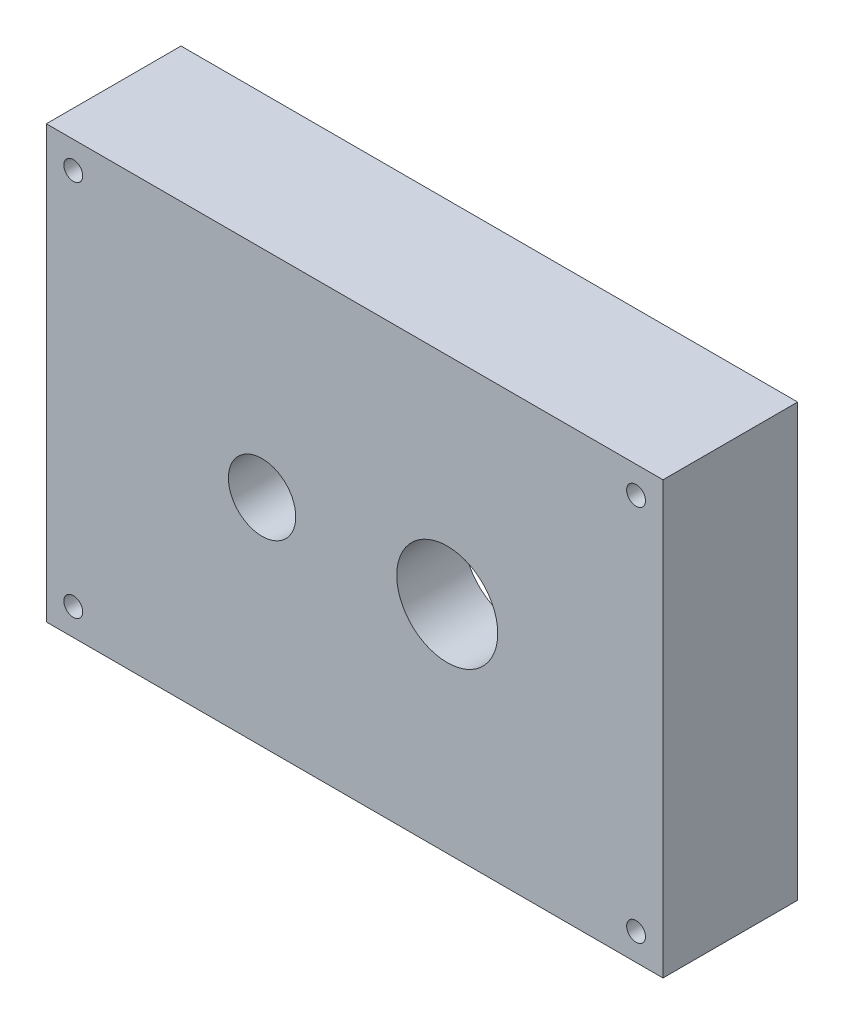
ISO-10303-21;
HEADER;
FILE_DESCRIPTION(('STEP AP214'),'2;1');
FILE_NAME('part.step','',(''),(''),'','','');
FILE_SCHEMA(('AUTOMOTIVE_DESIGN { 1 0 10303 214 1 1 1 1 }'));
ENDSEC;
DATA;
#1=APPLICATION_CONTEXT('core data for automotive mechanical design processes');
#2=APPLICATION_PROTOCOL_DEFINITION('international standard','automotive_design',2000,#1);
#3=PRODUCT_CONTEXT('',#1,'mechanical');
#4=PRODUCT('Part','Part','',(#3));
#5=PRODUCT_RELATED_PRODUCT_CATEGORY('part','',(#4));
#6=PRODUCT_DEFINITION_FORMATION('','',#4);
#7=PRODUCT_DEFINITION_CONTEXT('part definition',#1,'design');
#8=PRODUCT_DEFINITION('design','',#6,#7);
#9=PRODUCT_DEFINITION_SHAPE('','',#8);
#10=(LENGTH_UNIT() NAMED_UNIT(*) SI_UNIT(.MILLI.,.METRE.));
#11=(NAMED_UNIT(*) PLANE_ANGLE_UNIT() SI_UNIT($,.RADIAN.));
#12=(NAMED_UNIT(*) SI_UNIT($,.STERADIAN.) SOLID_ANGLE_UNIT());
#13=UNCERTAINTY_MEASURE_WITH_UNIT(LENGTH_MEASURE(1.E-05),#10,'distance_accuracy_value','');
#14=(GEOMETRIC_REPRESENTATION_CONTEXT(3) GLOBAL_UNCERTAINTY_ASSIGNED_CONTEXT((#13)) GLOBAL_UNIT_ASSIGNED_CONTEXT((#10,
#11,#12)) REPRESENTATION_CONTEXT('',''));
#15=CARTESIAN_POINT('',(0.,0.,0.));
#16=DIRECTION('',(0.,0.,1.));
#17=DIRECTION('',(1.,0.,0.));
#18=AXIS2_PLACEMENT_3D('',#15,#16,#17);
#19=CARTESIAN_POINT('',(0.,0.,0.));
#20=DIRECTION('',(0.,0.,-1.));
#21=DIRECTION('',(-1.,0.,0.));
#22=AXIS2_PLACEMENT_3D('',#19,#20,#21);
#23=PLANE('',#22);
#24=CARTESIAN_POINT('',(-26.53665,17.8054,0.));
#25=DIRECTION('',(0.,0.,1.));
#26=DIRECTION('',(1.,0.,0.));
#27=AXIS2_PLACEMENT_3D('',#24,#25,#26);
#28=CIRCLE('',#27,0.889);
#29=CARTESIAN_POINT('',(-25.64765,17.8054,0.));
#30=VERTEX_POINT('',#29);
#31=EDGE_CURVE('E341',#30,#30,#28,.T.);
#32=ORIENTED_EDGE('',*,*,#31,.T.);
#33=EDGE_LOOP('',(#32));
#34=FACE_BOUND('',#33,.T.);
#35=CARTESIAN_POINT('',(26.53665,-17.8054,0.));
#36=DIRECTION('',(0.,0.,1.));
#37=DIRECTION('',(1.,0.,0.));
#38=AXIS2_PLACEMENT_3D('',#35,#36,#37);
#39=CIRCLE('',#38,0.889);
#40=CARTESIAN_POINT('',(27.42565,-17.8054,0.));
#41=VERTEX_POINT('',#40);
#42=EDGE_CURVE('E346',#41,#41,#39,.T.);
#43=ORIENTED_EDGE('',*,*,#42,.T.);
#44=EDGE_LOOP('',(#43));
#45=FACE_BOUND('',#44,.T.);
#46=CARTESIAN_POINT('',(-26.53665,-17.8054,0.));
#47=DIRECTION('',(0.,0.,1.));
#48=DIRECTION('',(1.,0.,0.));
#49=AXIS2_PLACEMENT_3D('',#46,#47,#48);
#50=CIRCLE('',#49,0.889);
#51=CARTESIAN_POINT('',(-25.64765,-17.8054,0.));
#52=VERTEX_POINT('',#51);
#53=EDGE_CURVE('E352',#52,#52,#50,.T.);
#54=ORIENTED_EDGE('',*,*,#53,.T.);
#55=EDGE_LOOP('',(#54));
#56=FACE_BOUND('',#55,.T.);
#57=CARTESIAN_POINT('',(26.53665,17.8054,0.));
#58=DIRECTION('',(0.,0.,1.));
#59=DIRECTION('',(1.,0.,0.));
#60=AXIS2_PLACEMENT_3D('',#57,#58,#59);
#61=CIRCLE('',#60,0.889);
#62=CARTESIAN_POINT('',(27.42565,17.8054,0.));
#63=VERTEX_POINT('',#62);
#64=EDGE_CURVE('E180',#63,#63,#61,.T.);
#65=ORIENTED_EDGE('',*,*,#64,.T.);
#66=EDGE_LOOP('',(#65));
#67=FACE_BOUND('',#66,.T.);
#68=DIRECTION('',(0.,1.,0.));
#69=VECTOR('',#68,1.);
#70=CARTESIAN_POINT('',(29.07665,-20.3454,0.));
#71=LINE('',#70,#69);
#72=CARTESIAN_POINT('',(29.07665,-20.3454,0.));
#73=VERTEX_POINT('',#72);
#74=CARTESIAN_POINT('',(29.07665,20.3454,0.));
#75=VERTEX_POINT('',#74);
#76=EDGE_CURVE('E140',#73,#75,#71,.T.);
#77=ORIENTED_EDGE('',*,*,#76,.F.);
#78=DIRECTION('',(1.,0.,0.));
#79=VECTOR('',#78,1.);
#80=CARTESIAN_POINT('',(-29.07665,-20.3454,0.));
#81=LINE('',#80,#79);
#82=CARTESIAN_POINT('',(-29.07665,-20.3454,0.));
#83=VERTEX_POINT('',#82);
#84=EDGE_CURVE('E86',#83,#73,#81,.T.);
#85=ORIENTED_EDGE('',*,*,#84,.F.);
#86=DIRECTION('',(0.,-1.,0.));
#87=VECTOR('',#86,1.);
#88=CARTESIAN_POINT('',(-29.07665,-20.3454,0.));
#89=LINE('',#88,#87);
#90=CARTESIAN_POINT('',(-29.07665,20.3454,0.));
#91=VERTEX_POINT('',#90);
#92=EDGE_CURVE('E154',#91,#83,#89,.T.);
#93=ORIENTED_EDGE('',*,*,#92,.F.);
#94=DIRECTION('',(-1.,0.,0.));
#95=VECTOR('',#94,1.);
#96=CARTESIAN_POINT('',(-29.07665,20.3454,0.));
#97=LINE('',#96,#95);
#98=EDGE_CURVE('E143',#75,#91,#97,.T.);
#99=ORIENTED_EDGE('',*,*,#98,.F.);
#100=EDGE_LOOP('',(#77,#85,#93,#99));
#101=FACE_BOUND('',#100,.T.);
#102=DIRECTION('',(1.,0.,0.));
#103=VECTOR('',#102,1.);
#104=CARTESIAN_POINT('',(-23.99665,-15.2654,0.));
#105=LINE('',#104,#103);
#106=CARTESIAN_POINT('',(-23.99665,-15.2654,0.));
#107=VERTEX_POINT('',#106);
#108=CARTESIAN_POINT('',(23.99665,-15.2654,0.));
#109=VERTEX_POINT('',#108);
#110=EDGE_CURVE('E131',#107,#109,#105,.T.);
#111=ORIENTED_EDGE('',*,*,#110,.T.);
#112=DIRECTION('',(0.,1.,0.));
#113=VECTOR('',#112,1.);
#114=CARTESIAN_POINT('',(23.99665,-15.2654,0.));
#115=LINE('',#114,#113);
#116=CARTESIAN_POINT('',(23.99665,15.2654,0.));
#117=VERTEX_POINT('',#116);
#118=EDGE_CURVE('E59',#109,#117,#115,.T.);
#119=ORIENTED_EDGE('',*,*,#118,.T.);
#120=DIRECTION('',(-1.,0.,0.));
#121=VECTOR('',#120,1.);
#122=CARTESIAN_POINT('',(-23.99665,15.2654,0.));
#123=LINE('',#122,#121);
#124=CARTESIAN_POINT('',(-23.99665,15.2654,0.));
#125=VERTEX_POINT('',#124);
#126=EDGE_CURVE('E137',#117,#125,#123,.T.);
#127=ORIENTED_EDGE('',*,*,#126,.T.);
#128=DIRECTION('',(0.,-1.,0.));
#129=VECTOR('',#128,1.);
#130=CARTESIAN_POINT('',(-23.99665,-15.2654,0.));
#131=LINE('',#130,#129);
#132=EDGE_CURVE('E183',#125,#107,#131,.T.);
#133=ORIENTED_EDGE('',*,*,#132,.T.);
#134=EDGE_LOOP('',(#111,#119,#127,#133));
#135=FACE_BOUND('',#134,.T.);
#136=ADVANCED_FACE('F41',(#34,#45,#56,#67,#101,#135),#23,.T.);
#137=CARTESIAN_POINT('',(29.07665,-20.3454,12.7));
#138=DIRECTION('',(-1.,0.,0.));
#139=DIRECTION('',(0.,0.,1.));
#140=AXIS2_PLACEMENT_3D('',#137,#138,#139);
#141=PLANE('',#140);
#142=ORIENTED_EDGE('',*,*,#76,.T.);
#143=DIRECTION('',(0.,0.,-1.));
#144=VECTOR('',#143,1.);
#145=CARTESIAN_POINT('',(29.07665,20.3454,12.7));
#146=LINE('',#145,#144);
#147=CARTESIAN_POINT('',(29.07665,20.3454,12.7));
#148=VERTEX_POINT('',#147);
#149=EDGE_CURVE('E11',#148,#75,#146,.T.);
#150=ORIENTED_EDGE('',*,*,#149,.F.);
#151=DIRECTION('',(0.,1.,0.));
#152=VECTOR('',#151,1.);
#153=CARTESIAN_POINT('',(29.07665,-20.3454,12.7));
#154=LINE('',#153,#152);
#155=CARTESIAN_POINT('',(29.07665,-20.3454,12.7));
#156=VERTEX_POINT('',#155);
#157=EDGE_CURVE('E150',#156,#148,#154,.T.);
#158=ORIENTED_EDGE('',*,*,#157,.F.);
#159=DIRECTION('',(0.,0.,-1.));
#160=VECTOR('',#159,1.);
#161=CARTESIAN_POINT('',(29.07665,-20.3454,12.7));
#162=LINE('',#161,#160);
#163=EDGE_CURVE('E155',#156,#73,#162,.T.);
#164=ORIENTED_EDGE('',*,*,#163,.T.);
#165=EDGE_LOOP('',(#142,#150,#158,#164));
#166=FACE_BOUND('',#165,.T.);
#167=ADVANCED_FACE('F43',(#166),#141,.F.);
#168=CARTESIAN_POINT('',(-29.07665,20.3454,12.7));
#169=DIRECTION('',(0.,-1.,0.));
#170=DIRECTION('',(0.,0.,-1.));
#171=AXIS2_PLACEMENT_3D('',#168,#169,#170);
#172=PLANE('',#171);
#173=ORIENTED_EDGE('',*,*,#98,.T.);
#174=DIRECTION('',(0.,0.,-1.));
#175=VECTOR('',#174,1.);
#176=CARTESIAN_POINT('',(-29.07665,20.3454,12.7));
#177=LINE('',#176,#175);
#178=CARTESIAN_POINT('',(-29.07665,20.3454,12.7));
#179=VERTEX_POINT('',#178);
#180=EDGE_CURVE('E49',#179,#91,#177,.T.);
#181=ORIENTED_EDGE('',*,*,#180,.F.);
#182=DIRECTION('',(-1.,0.,0.));
#183=VECTOR('',#182,1.);
#184=CARTESIAN_POINT('',(-29.07665,20.3454,12.7));
#185=LINE('',#184,#183);
#186=EDGE_CURVE('E92',#148,#179,#185,.T.);
#187=ORIENTED_EDGE('',*,*,#186,.F.);
#188=ORIENTED_EDGE('',*,*,#149,.T.);
#189=EDGE_LOOP('',(#173,#181,#187,#188));
#190=FACE_BOUND('',#189,.T.);
#191=ADVANCED_FACE('F206',(#190),#172,.F.);
#192=CARTESIAN_POINT('',(-29.07665,-20.3454,12.7));
#193=DIRECTION('',(1.,0.,0.));
#194=DIRECTION('',(0.,0.,-1.));
#195=AXIS2_PLACEMENT_3D('',#192,#193,#194);
#196=PLANE('',#195);
#197=ORIENTED_EDGE('',*,*,#92,.T.);
#198=DIRECTION('',(0.,0.,-1.));
#199=VECTOR('',#198,1.);
#200=CARTESIAN_POINT('',(-29.07665,-20.3454,12.7));
#201=LINE('',#200,#199);
#202=CARTESIAN_POINT('',(-29.07665,-20.3454,12.7));
#203=VERTEX_POINT('',#202);
#204=EDGE_CURVE('E157',#203,#83,#201,.T.);
#205=ORIENTED_EDGE('',*,*,#204,.F.);
#206=DIRECTION('',(0.,-1.,0.));
#207=VECTOR('',#206,1.);
#208=CARTESIAN_POINT('',(-29.07665,-20.3454,12.7));
#209=LINE('',#208,#207);
#210=EDGE_CURVE('E147',#179,#203,#209,.T.);
#211=ORIENTED_EDGE('',*,*,#210,.F.);
#212=ORIENTED_EDGE('',*,*,#180,.T.);
#213=EDGE_LOOP('',(#197,#205,#211,#212));
#214=FACE_BOUND('',#213,.T.);
#215=ADVANCED_FACE('F220',(#214),#196,.F.);
#216=CARTESIAN_POINT('',(-29.07665,-20.3454,12.7));
#217=DIRECTION('',(0.,1.,0.));
#218=DIRECTION('',(0.,0.,1.));
#219=AXIS2_PLACEMENT_3D('',#216,#217,#218);
#220=PLANE('',#219);
#221=ORIENTED_EDGE('',*,*,#84,.T.);
#222=ORIENTED_EDGE('',*,*,#163,.F.);
#223=DIRECTION('',(1.,0.,0.));
#224=VECTOR('',#223,1.);
#225=CARTESIAN_POINT('',(-29.07665,-20.3454,12.7));
#226=LINE('',#225,#224);
#227=EDGE_CURVE('E70',#203,#156,#226,.T.);
#228=ORIENTED_EDGE('',*,*,#227,.F.);
#229=ORIENTED_EDGE('',*,*,#204,.T.);
#230=EDGE_LOOP('',(#221,#222,#228,#229));
#231=FACE_BOUND('',#230,.T.);
#232=ADVANCED_FACE('F212',(#231),#220,.F.);
#233=CARTESIAN_POINT('',(0.,0.,12.7));
#234=DIRECTION('',(0.,0.,-1.));
#235=DIRECTION('',(-1.,0.,0.));
#236=AXIS2_PLACEMENT_3D('',#233,#234,#235);
#237=PLANE('',#236);
#238=CARTESIAN_POINT('',(-26.53665,17.8054,12.7));
#239=DIRECTION('',(0.,0.,1.));
#240=DIRECTION('',(1.,0.,0.));
#241=AXIS2_PLACEMENT_3D('',#238,#239,#240);
#242=CIRCLE('',#241,0.889);
#243=CARTESIAN_POINT('',(-25.64765,17.8054,12.7));
#244=VERTEX_POINT('',#243);
#245=EDGE_CURVE('E236',#244,#244,#242,.T.);
#246=ORIENTED_EDGE('',*,*,#245,.F.);
#247=EDGE_LOOP('',(#246));
#248=FACE_BOUND('',#247,.T.);
#249=CARTESIAN_POINT('',(26.53665,-17.8054,12.7));
#250=DIRECTION('',(0.,0.,1.));
#251=DIRECTION('',(1.,0.,0.));
#252=AXIS2_PLACEMENT_3D('',#249,#250,#251);
#253=CIRCLE('',#252,0.889);
#254=CARTESIAN_POINT('',(27.42565,-17.8054,12.7));
#255=VERTEX_POINT('',#254);
#256=EDGE_CURVE('E241',#255,#255,#253,.T.);
#257=ORIENTED_EDGE('',*,*,#256,.F.);
#258=EDGE_LOOP('',(#257));
#259=FACE_BOUND('',#258,.T.);
#260=CARTESIAN_POINT('',(-26.53665,-17.8054,12.7));
#261=DIRECTION('',(0.,0.,1.));
#262=DIRECTION('',(1.,0.,0.));
#263=AXIS2_PLACEMENT_3D('',#260,#261,#262);
#264=CIRCLE('',#263,0.889);
#265=CARTESIAN_POINT('',(-25.64765,-17.8054,12.7));
#266=VERTEX_POINT('',#265);
#267=EDGE_CURVE('E247',#266,#266,#264,.T.);
#268=ORIENTED_EDGE('',*,*,#267,.F.);
#269=EDGE_LOOP('',(#268));
#270=FACE_BOUND('',#269,.T.);
#271=CARTESIAN_POINT('',(26.53665,17.8054,12.7));
#272=DIRECTION('',(0.,0.,1.));
#273=DIRECTION('',(1.,0.,0.));
#274=AXIS2_PLACEMENT_3D('',#271,#272,#273);
#275=CIRCLE('',#274,0.889);
#276=CARTESIAN_POINT('',(27.42565,17.8054,12.7));
#277=VERTEX_POINT('',#276);
#278=EDGE_CURVE('E173',#277,#277,#275,.T.);
#279=ORIENTED_EDGE('',*,*,#278,.F.);
#280=EDGE_LOOP('',(#279));
#281=FACE_BOUND('',#280,.T.);
#282=CARTESIAN_POINT('',(-8.73125,0.,12.7));
#283=DIRECTION('',(0.,0.,1.));
#284=DIRECTION('',(1.,0.,0.));
#285=AXIS2_PLACEMENT_3D('',#282,#283,#284);
#286=CIRCLE('',#285,3.175);
#287=CARTESIAN_POINT('',(-5.55625,0.,12.7));
#288=VERTEX_POINT('',#287);
#289=EDGE_CURVE('E163',#288,#288,#286,.T.);
#290=ORIENTED_EDGE('',*,*,#289,.F.);
#291=EDGE_LOOP('',(#290));
#292=FACE_BOUND('',#291,.T.);
#293=CARTESIAN_POINT('',(8.73125,0.,12.7));
#294=DIRECTION('',(0.,0.,1.));
#295=DIRECTION('',(1.,0.,0.));
#296=AXIS2_PLACEMENT_3D('',#293,#294,#295);
#297=CIRCLE('',#296,4.7625);
#298=CARTESIAN_POINT('',(13.49375,0.,12.7));
#299=VERTEX_POINT('',#298);
#300=EDGE_CURVE('E166',#299,#299,#297,.T.);
#301=ORIENTED_EDGE('',*,*,#300,.F.);
#302=EDGE_LOOP('',(#301));
#303=FACE_BOUND('',#302,.T.);
#304=ORIENTED_EDGE('',*,*,#157,.T.);
#305=ORIENTED_EDGE('',*,*,#186,.T.);
#306=ORIENTED_EDGE('',*,*,#210,.T.);
#307=ORIENTED_EDGE('',*,*,#227,.T.);
#308=EDGE_LOOP('',(#304,#305,#306,#307));
#309=FACE_BOUND('',#308,.T.);
#310=ADVANCED_FACE('F215',(#248,#259,#270,#281,#292,#303,#309),#237,.F.);
#311=CARTESIAN_POINT('',(23.99665,-15.2654,6.35));
#312=DIRECTION('',(-1.,0.,0.));
#313=DIRECTION('',(0.,0.,1.));
#314=AXIS2_PLACEMENT_3D('',#311,#312,#313);
#315=PLANE('',#314);
#316=ORIENTED_EDGE('',*,*,#118,.F.);
#317=DIRECTION('',(0.,0.,-1.));
#318=VECTOR('',#317,1.);
#319=CARTESIAN_POINT('',(23.99665,-15.2654,6.35));
#320=LINE('',#319,#318);
#321=CARTESIAN_POINT('',(23.99665,-15.2654,6.35));
#322=VERTEX_POINT('',#321);
#323=EDGE_CURVE('E134',#322,#109,#320,.T.);
#324=ORIENTED_EDGE('',*,*,#323,.F.);
#325=DIRECTION('',(0.,1.,0.));
#326=VECTOR('',#325,1.);
#327=CARTESIAN_POINT('',(23.99665,-15.2654,6.35));
#328=LINE('',#327,#326);
#329=CARTESIAN_POINT('',(23.99665,15.2654,6.35));
#330=VERTEX_POINT('',#329);
#331=EDGE_CURVE('E123',#322,#330,#328,.T.);
#332=ORIENTED_EDGE('',*,*,#331,.T.);
#333=DIRECTION('',(0.,0.,-1.));
#334=VECTOR('',#333,1.);
#335=CARTESIAN_POINT('',(23.99665,15.2654,6.35));
#336=LINE('',#335,#334);
#337=EDGE_CURVE('E128',#330,#117,#336,.T.);
#338=ORIENTED_EDGE('',*,*,#337,.T.);
#339=EDGE_LOOP('',(#316,#324,#332,#338));
#340=FACE_BOUND('',#339,.T.);
#341=ADVANCED_FACE('F129',(#340),#315,.T.);
#342=CARTESIAN_POINT('',(-23.99665,15.2654,6.35));
#343=DIRECTION('',(0.,-1.,0.));
#344=DIRECTION('',(0.,0.,-1.));
#345=AXIS2_PLACEMENT_3D('',#342,#343,#344);
#346=PLANE('',#345);
#347=ORIENTED_EDGE('',*,*,#126,.F.);
#348=ORIENTED_EDGE('',*,*,#337,.F.);
#349=DIRECTION('',(-1.,0.,0.));
#350=VECTOR('',#349,1.);
#351=CARTESIAN_POINT('',(-23.99665,15.2654,6.35));
#352=LINE('',#351,#350);
#353=CARTESIAN_POINT('',(-23.99665,15.2654,6.35));
#354=VERTEX_POINT('',#353);
#355=EDGE_CURVE('E118',#330,#354,#352,.T.);
#356=ORIENTED_EDGE('',*,*,#355,.T.);
#357=DIRECTION('',(0.,0.,-1.));
#358=VECTOR('',#357,1.);
#359=CARTESIAN_POINT('',(-23.99665,15.2654,6.35));
#360=LINE('',#359,#358);
#361=EDGE_CURVE('E138',#354,#125,#360,.T.);
#362=ORIENTED_EDGE('',*,*,#361,.T.);
#363=EDGE_LOOP('',(#347,#348,#356,#362));
#364=FACE_BOUND('',#363,.T.);
#365=ADVANCED_FACE('F133',(#364),#346,.T.);
#366=CARTESIAN_POINT('',(-23.99665,-15.2654,6.35));
#367=DIRECTION('',(1.,0.,0.));
#368=DIRECTION('',(0.,0.,-1.));
#369=AXIS2_PLACEMENT_3D('',#366,#367,#368);
#370=PLANE('',#369);
#371=ORIENTED_EDGE('',*,*,#132,.F.);
#372=ORIENTED_EDGE('',*,*,#361,.F.);
#373=DIRECTION('',(0.,-1.,0.));
#374=VECTOR('',#373,1.);
#375=CARTESIAN_POINT('',(-23.99665,-15.2654,6.35));
#376=LINE('',#375,#374);
#377=CARTESIAN_POINT('',(-23.99665,-15.2654,6.35));
#378=VERTEX_POINT('',#377);
#379=EDGE_CURVE('E124',#354,#378,#376,.T.);
#380=ORIENTED_EDGE('',*,*,#379,.T.);
#381=DIRECTION('',(0.,0.,-1.));
#382=VECTOR('',#381,1.);
#383=CARTESIAN_POINT('',(-23.99665,-15.2654,6.35));
#384=LINE('',#383,#382);
#385=EDGE_CURVE('E141',#378,#107,#384,.T.);
#386=ORIENTED_EDGE('',*,*,#385,.T.);
#387=EDGE_LOOP('',(#371,#372,#380,#386));
#388=FACE_BOUND('',#387,.T.);
#389=ADVANCED_FACE('F194',(#388),#370,.T.);
#390=CARTESIAN_POINT('',(-23.99665,-15.2654,6.35));
#391=DIRECTION('',(0.,1.,0.));
#392=DIRECTION('',(0.,0.,1.));
#393=AXIS2_PLACEMENT_3D('',#390,#391,#392);
#394=PLANE('',#393);
#395=ORIENTED_EDGE('',*,*,#110,.F.);
#396=ORIENTED_EDGE('',*,*,#385,.F.);
#397=DIRECTION('',(1.,0.,0.));
#398=VECTOR('',#397,1.);
#399=CARTESIAN_POINT('',(-23.99665,-15.2654,6.35));
#400=LINE('',#399,#398);
#401=EDGE_CURVE('E182',#378,#322,#400,.T.);
#402=ORIENTED_EDGE('',*,*,#401,.T.);
#403=ORIENTED_EDGE('',*,*,#323,.T.);
#404=EDGE_LOOP('',(#395,#396,#402,#403));
#405=FACE_BOUND('',#404,.T.);
#406=ADVANCED_FACE('F198',(#405),#394,.T.);
#407=CARTESIAN_POINT('',(0.,0.,6.35));
#408=DIRECTION('',(0.,0.,-1.));
#409=DIRECTION('',(-1.,0.,0.));
#410=AXIS2_PLACEMENT_3D('',#407,#408,#409);
#411=PLANE('',#410);
#412=CARTESIAN_POINT('',(-8.73125,0.,6.35));
#413=DIRECTION('',(0.,0.,-1.));
#414=DIRECTION('',(-1.,0.,0.));
#415=AXIS2_PLACEMENT_3D('',#412,#413,#414);
#416=CIRCLE('',#415,3.175);
#417=CARTESIAN_POINT('',(-11.90625,0.,6.35));
#418=VERTEX_POINT('',#417);
#419=EDGE_CURVE('E44',#418,#418,#416,.F.);
#420=ORIENTED_EDGE('',*,*,#419,.T.);
#421=EDGE_LOOP('',(#420));
#422=FACE_BOUND('',#421,.T.);
#423=CARTESIAN_POINT('',(8.73125,0.,6.35));
#424=DIRECTION('',(0.,0.,-1.));
#425=DIRECTION('',(-1.,0.,0.));
#426=AXIS2_PLACEMENT_3D('',#423,#424,#425);
#427=CIRCLE('',#426,4.7625);
#428=CARTESIAN_POINT('',(3.96875,0.,6.35));
#429=VERTEX_POINT('',#428);
#430=EDGE_CURVE('E165',#429,#429,#427,.F.);
#431=ORIENTED_EDGE('',*,*,#430,.T.);
#432=EDGE_LOOP('',(#431));
#433=FACE_BOUND('',#432,.T.);
#434=ORIENTED_EDGE('',*,*,#331,.F.);
#435=ORIENTED_EDGE('',*,*,#401,.F.);
#436=ORIENTED_EDGE('',*,*,#379,.F.);
#437=ORIENTED_EDGE('',*,*,#355,.F.);
#438=EDGE_LOOP('',(#434,#435,#436,#437));
#439=FACE_BOUND('',#438,.T.);
#440=ADVANCED_FACE('F122',(#422,#433,#439),#411,.T.);
#441=CARTESIAN_POINT('',(8.73125,0.,12.7));
#442=DIRECTION('',(0.,0.,-1.));
#443=DIRECTION('',(-1.,0.,0.));
#444=AXIS2_PLACEMENT_3D('',#441,#442,#443);
#445=CYLINDRICAL_SURFACE('',#444,4.7625);
#446=ORIENTED_EDGE('',*,*,#430,.F.);
#447=EDGE_LOOP('',(#446));
#448=FACE_BOUND('',#447,.T.);
#449=ORIENTED_EDGE('',*,*,#300,.T.);
#450=EDGE_LOOP('',(#449));
#451=FACE_BOUND('',#450,.T.);
#452=ADVANCED_FACE('F251',(#448,#451),#445,.F.);
#453=CARTESIAN_POINT('',(-8.73125,0.,12.7));
#454=DIRECTION('',(0.,0.,-1.));
#455=DIRECTION('',(-1.,0.,0.));
#456=AXIS2_PLACEMENT_3D('',#453,#454,#455);
#457=CYLINDRICAL_SURFACE('',#456,3.175);
#458=ORIENTED_EDGE('',*,*,#419,.F.);
#459=EDGE_LOOP('',(#458));
#460=FACE_BOUND('',#459,.T.);
#461=ORIENTED_EDGE('',*,*,#289,.T.);
#462=EDGE_LOOP('',(#461));
#463=FACE_BOUND('',#462,.T.);
#464=ADVANCED_FACE('F254',(#460,#463),#457,.F.);
#465=CARTESIAN_POINT('',(26.53665,17.8054,12.7));
#466=DIRECTION('',(0.,0.,-1.));
#467=DIRECTION('',(-1.,0.,0.));
#468=AXIS2_PLACEMENT_3D('',#465,#466,#467);
#469=CYLINDRICAL_SURFACE('',#468,0.889);
#470=ORIENTED_EDGE('',*,*,#278,.T.);
#471=EDGE_LOOP('',(#470));
#472=FACE_BOUND('',#471,.T.);
#473=ORIENTED_EDGE('',*,*,#64,.F.);
#474=EDGE_LOOP('',(#473));
#475=FACE_BOUND('',#474,.T.);
#476=ADVANCED_FACE('F261',(#472,#475),#469,.F.);
#477=CARTESIAN_POINT('',(-26.53665,-17.8054,12.7));
#478=DIRECTION('',(0.,0.,-1.));
#479=DIRECTION('',(-1.,0.,0.));
#480=AXIS2_PLACEMENT_3D('',#477,#478,#479);
#481=CYLINDRICAL_SURFACE('',#480,0.889);
#482=ORIENTED_EDGE('',*,*,#267,.T.);
#483=EDGE_LOOP('',(#482));
#484=FACE_BOUND('',#483,.T.);
#485=ORIENTED_EDGE('',*,*,#53,.F.);
#486=EDGE_LOOP('',(#485));
#487=FACE_BOUND('',#486,.T.);
#488=ADVANCED_FACE('F313',(#484,#487),#481,.F.);
#489=CARTESIAN_POINT('',(26.53665,-17.8054,12.7));
#490=DIRECTION('',(0.,0.,-1.));
#491=DIRECTION('',(-1.,0.,0.));
#492=AXIS2_PLACEMENT_3D('',#489,#490,#491);
#493=CYLINDRICAL_SURFACE('',#492,0.889);
#494=ORIENTED_EDGE('',*,*,#256,.T.);
#495=EDGE_LOOP('',(#494));
#496=FACE_BOUND('',#495,.T.);
#497=ORIENTED_EDGE('',*,*,#42,.F.);
#498=EDGE_LOOP('',(#497));
#499=FACE_BOUND('',#498,.T.);
#500=ADVANCED_FACE('F319',(#496,#499),#493,.F.);
#501=CARTESIAN_POINT('',(-26.53665,17.8054,12.7));
#502=DIRECTION('',(0.,0.,-1.));
#503=DIRECTION('',(-1.,0.,0.));
#504=AXIS2_PLACEMENT_3D('',#501,#502,#503);
#505=CYLINDRICAL_SURFACE('',#504,0.889);
#506=ORIENTED_EDGE('',*,*,#245,.T.);
#507=EDGE_LOOP('',(#506));
#508=FACE_BOUND('',#507,.T.);
#509=ORIENTED_EDGE('',*,*,#31,.F.);
#510=EDGE_LOOP('',(#509));
#511=FACE_BOUND('',#510,.T.);
#512=ADVANCED_FACE('F329',(#508,#511),#505,.F.);
#513=CLOSED_SHELL('',(#136,#167,#191,#215,#232,#310,#341,#365,#389,#406,#440,#452,#464,#476,
#488,#500,#512));
#514=MANIFOLD_SOLID_BREP('B2',#513);
#515=ADVANCED_BREP_SHAPE_REPRESENTATION('',(#18,#514),#14);
#516=SHAPE_DEFINITION_REPRESENTATION(#9,#515);
ENDSEC;
END-ISO-10303-21;
